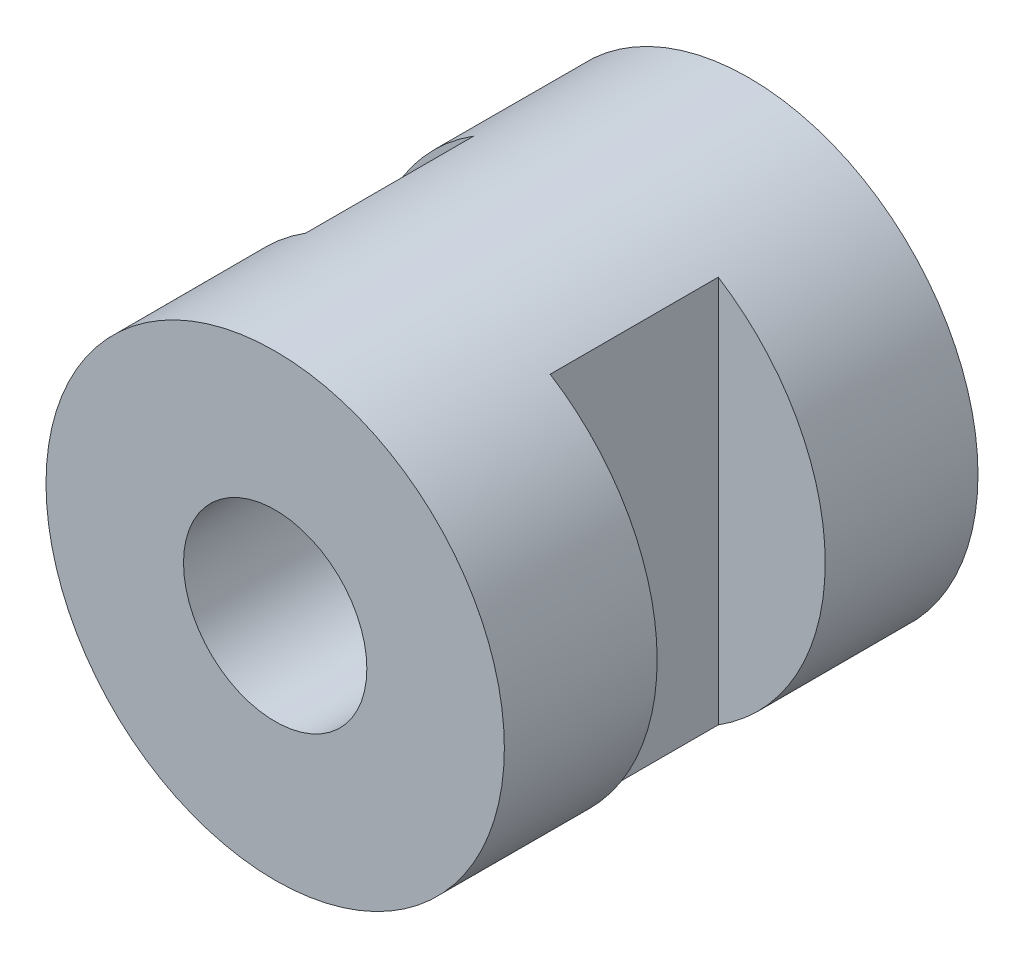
from build123d import *

# Parameters (mm, degrees)
SKETCH_1_R          = 7.5
EXTRUDE_1_DEPTH     = 15.5
SKETCH_2_W          = 4.753389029
SKETCH_2_H          = 5.5
CUT_EXTRUDE_1_DEPTH = 25.550967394
SKETCH_3_R          = 3
CUT_EXTRUDE_2_DEPTH = 15.5


with BuildPart() as part:
    # Sketch 1 → Extrude 1 (new body)
    with BuildSketch(Plane.XY):
        Circle(SKETCH_1_R)
    extrude(amount=EXTRUDE_1_DEPTH)

    # Sketch 2 → Cut-Extrude 1 (cut, through all)
    with BuildSketch(Plane(origin=(0, 10, 0), x_dir=(-1, 0, 0), z_dir=(0, 1, 0))):
        with Locations((-6.376694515, 7.75)):
            Rectangle(SKETCH_2_W, SKETCH_2_H)
        with Locations((6.376694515, 7.75)):
            Rectangle(SKETCH_2_W, SKETCH_2_H)
    extrude(amount=-CUT_EXTRUDE_1_DEPTH, mode=Mode.SUBTRACT)

    # Sketch 3 → Cut-Extrude 2 (cut)
    with BuildSketch(Plane(origin=(0, 0, 0), x_dir=(-1, 0, 0), z_dir=(0, 0, -1))):
        Circle(SKETCH_3_R)
    extrude(amount=-CUT_EXTRUDE_2_DEPTH, mode=Mode.SUBTRACT)


solid = part.part
